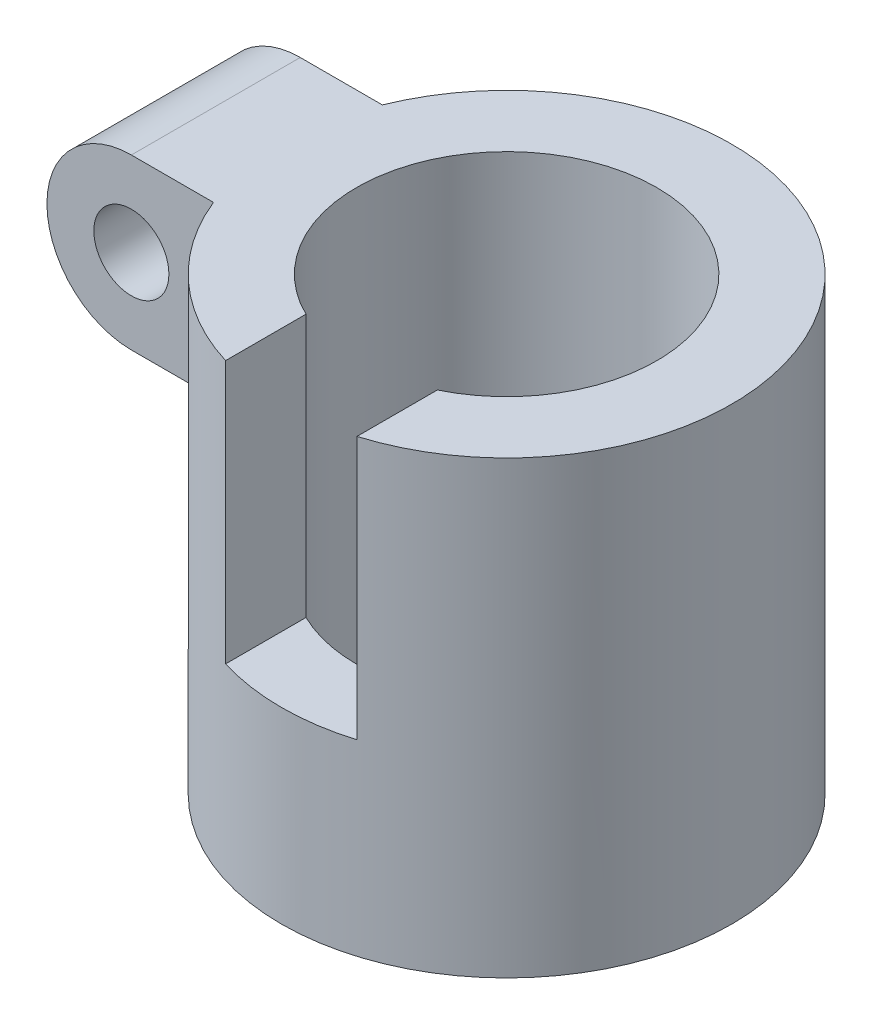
ISO-10303-21;
HEADER;
FILE_DESCRIPTION(('STEP AP214'),'2;1');
FILE_NAME('part.step','',(''),(''),'','','');
FILE_SCHEMA(('AUTOMOTIVE_DESIGN { 1 0 10303 214 1 1 1 1 }'));
ENDSEC;
DATA;
#1=APPLICATION_CONTEXT('core data for automotive mechanical design processes');
#2=APPLICATION_PROTOCOL_DEFINITION('international standard','automotive_design',2000,#1);
#3=PRODUCT_CONTEXT('',#1,'mechanical');
#4=PRODUCT('Part','Part','',(#3));
#5=PRODUCT_RELATED_PRODUCT_CATEGORY('part','',(#4));
#6=PRODUCT_DEFINITION_FORMATION('','',#4);
#7=PRODUCT_DEFINITION_CONTEXT('part definition',#1,'design');
#8=PRODUCT_DEFINITION('design','',#6,#7);
#9=PRODUCT_DEFINITION_SHAPE('','',#8);
#10=(LENGTH_UNIT() NAMED_UNIT(*) SI_UNIT(.MILLI.,.METRE.));
#11=(NAMED_UNIT(*) PLANE_ANGLE_UNIT() SI_UNIT($,.RADIAN.));
#12=(NAMED_UNIT(*) SI_UNIT($,.STERADIAN.) SOLID_ANGLE_UNIT());
#13=UNCERTAINTY_MEASURE_WITH_UNIT(LENGTH_MEASURE(1.E-05),#10,'distance_accuracy_value','');
#14=(GEOMETRIC_REPRESENTATION_CONTEXT(3) GLOBAL_UNCERTAINTY_ASSIGNED_CONTEXT((#13)) GLOBAL_UNIT_ASSIGNED_CONTEXT((#10,
#11,#12)) REPRESENTATION_CONTEXT('',''));
#15=CARTESIAN_POINT('',(0.,0.,0.));
#16=DIRECTION('',(0.,0.,1.));
#17=DIRECTION('',(1.,0.,0.));
#18=AXIS2_PLACEMENT_3D('',#15,#16,#17);
#19=CARTESIAN_POINT('',(-77.5,97.5,-22.5));
#20=DIRECTION('',(0.,0.,1.));
#21=DIRECTION('',(1.,0.,0.));
#22=AXIS2_PLACEMENT_3D('',#19,#20,#21);
#23=CYLINDRICAL_SURFACE('',#22,22.5);
#24=DIRECTION('',(0.,0.,-1.));
#25=VECTOR('',#24,1.);
#26=CARTESIAN_POINT('',(-77.5,120.,-22.5));
#27=LINE('',#26,#25);
#28=CARTESIAN_POINT('',(-77.5,120.,-22.5));
#29=VERTEX_POINT('',#28);
#30=CARTESIAN_POINT('',(-77.5,120.,22.5));
#31=VERTEX_POINT('',#30);
#32=EDGE_CURVE('E130',#29,#31,#27,.F.);
#33=ORIENTED_EDGE('',*,*,#32,.F.);
#34=CARTESIAN_POINT('',(-77.5,97.5,-22.5));
#35=DIRECTION('',(0.,0.,1.));
#36=DIRECTION('',(0.,-1.,0.));
#37=AXIS2_PLACEMENT_3D('',#34,#35,#36);
#38=CIRCLE('',#37,22.5);
#39=CARTESIAN_POINT('',(-77.5,75.,-22.5));
#40=VERTEX_POINT('',#39);
#41=EDGE_CURVE('E53',#40,#29,#38,.F.);
#42=ORIENTED_EDGE('',*,*,#41,.F.);
#43=DIRECTION('',(0.,0.,1.));
#44=VECTOR('',#43,1.);
#45=CARTESIAN_POINT('',(-77.5,75.,22.5));
#46=LINE('',#45,#44);
#47=CARTESIAN_POINT('',(-77.5,75.,22.5));
#48=VERTEX_POINT('',#47);
#49=EDGE_CURVE('E134',#48,#40,#46,.F.);
#50=ORIENTED_EDGE('',*,*,#49,.F.);
#51=CARTESIAN_POINT('',(-77.5,97.5,22.5));
#52=DIRECTION('',(0.,0.,-1.));
#53=DIRECTION('',(0.,1.,0.));
#54=AXIS2_PLACEMENT_3D('',#51,#52,#53);
#55=CIRCLE('',#54,22.5);
#56=EDGE_CURVE('E137',#31,#48,#55,.F.);
#57=ORIENTED_EDGE('',*,*,#56,.F.);
#58=EDGE_LOOP('',(#33,#42,#50,#57));
#59=FACE_BOUND('',#58,.T.);
#60=ADVANCED_FACE('F31',(#59),#23,.T.);
#61=CARTESIAN_POINT('',(0.,120.,0.));
#62=DIRECTION('',(0.,-1.,0.));
#63=DIRECTION('',(0.,0.,-1.));
#64=AXIS2_PLACEMENT_3D('',#61,#62,#63);
#65=CYLINDRICAL_SURFACE('',#64,60.);
#66=CARTESIAN_POINT('',(0.,0.,0.));
#67=DIRECTION('',(0.,1.,0.));
#68=DIRECTION('',(0.,0.,1.));
#69=AXIS2_PLACEMENT_3D('',#66,#67,#68);
#70=CIRCLE('',#69,60.);
#71=CARTESIAN_POINT('',(0.,0.,60.));
#72=VERTEX_POINT('',#71);
#73=EDGE_CURVE('E117',#72,#72,#70,.T.);
#74=ORIENTED_EDGE('',*,*,#73,.T.);
#75=EDGE_LOOP('',(#74));
#76=FACE_BOUND('',#75,.T.);
#77=CARTESIAN_POINT('',(0.,50.,0.));
#78=DIRECTION('',(0.,1.,0.));
#79=DIRECTION('',(0.,0.,1.));
#80=AXIS2_PLACEMENT_3D('',#77,#78,#79);
#81=CIRCLE('',#80,60.);
#82=CARTESIAN_POINT('',(-17.5,50.,57.391201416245));
#83=VERTEX_POINT('',#82);
#84=CARTESIAN_POINT('',(17.5,50.,57.391201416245));
#85=VERTEX_POINT('',#84);
#86=EDGE_CURVE('E150',#83,#85,#81,.T.);
#87=ORIENTED_EDGE('',*,*,#86,.F.);
#88=DIRECTION('',(0.,-1.,0.));
#89=VECTOR('',#88,1.);
#90=CARTESIAN_POINT('',(-17.5,120.,57.391201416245));
#91=LINE('',#90,#89);
#92=CARTESIAN_POINT('',(-17.5,120.,57.391201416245));
#93=VERTEX_POINT('',#92);
#94=EDGE_CURVE('E154',#83,#93,#91,.F.);
#95=ORIENTED_EDGE('',*,*,#94,.T.);
#96=CARTESIAN_POINT('',(0.,120.,0.));
#97=DIRECTION('',(0.,1.,0.));
#98=DIRECTION('',(0.,0.,1.));
#99=AXIS2_PLACEMENT_3D('',#96,#97,#98);
#100=CIRCLE('',#99,60.);
#101=CARTESIAN_POINT('',(-55.6214886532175,120.,22.5));
#102=VERTEX_POINT('',#101);
#103=EDGE_CURVE('E111',#102,#93,#100,.T.);
#104=ORIENTED_EDGE('',*,*,#103,.F.);
#105=DIRECTION('',(0.,-1.,0.));
#106=VECTOR('',#105,1.);
#107=CARTESIAN_POINT('',(-55.6214886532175,120.,22.5));
#108=LINE('',#107,#106);
#109=CARTESIAN_POINT('',(-55.6214886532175,75.,22.5));
#110=VERTEX_POINT('',#109);
#111=EDGE_CURVE('E165',#102,#110,#108,.T.);
#112=ORIENTED_EDGE('',*,*,#111,.T.);
#113=CARTESIAN_POINT('',(0.,75.,0.));
#114=DIRECTION('',(0.,1.,0.));
#115=DIRECTION('',(0.,0.,1.));
#116=AXIS2_PLACEMENT_3D('',#113,#114,#115);
#117=CIRCLE('',#116,60.);
#118=CARTESIAN_POINT('',(-55.6214886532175,75.,-22.5));
#119=VERTEX_POINT('',#118);
#120=EDGE_CURVE('E168',#110,#119,#117,.F.);
#121=ORIENTED_EDGE('',*,*,#120,.T.);
#122=DIRECTION('',(0.,-1.,0.));
#123=VECTOR('',#122,1.);
#124=CARTESIAN_POINT('',(-55.6214886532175,120.,-22.5));
#125=LINE('',#124,#123);
#126=CARTESIAN_POINT('',(-55.6214886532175,120.,-22.5));
#127=VERTEX_POINT('',#126);
#128=EDGE_CURVE('E124',#119,#127,#125,.F.);
#129=ORIENTED_EDGE('',*,*,#128,.T.);
#130=CARTESIAN_POINT('',(17.5,120.,57.391201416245));
#131=VERTEX_POINT('',#130);
#132=EDGE_CURVE('E121',#131,#127,#100,.T.);
#133=ORIENTED_EDGE('',*,*,#132,.F.);
#134=DIRECTION('',(0.,-1.,0.));
#135=VECTOR('',#134,1.);
#136=CARTESIAN_POINT('',(17.5,120.,57.391201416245));
#137=LINE('',#136,#135);
#138=EDGE_CURVE('E156',#131,#85,#137,.T.);
#139=ORIENTED_EDGE('',*,*,#138,.T.);
#140=EDGE_LOOP('',(#87,#95,#104,#112,#121,#129,#133,#139));
#141=FACE_BOUND('',#140,.T.);
#142=ADVANCED_FACE('F153',(#76,#141),#65,.T.);
#143=CARTESIAN_POINT('',(0.,120.,0.));
#144=DIRECTION('',(0.,1.,0.));
#145=DIRECTION('',(0.,0.,1.));
#146=AXIS2_PLACEMENT_3D('',#143,#144,#145);
#147=PLANE('',#146);
#148=DIRECTION('',(0.,0.,1.));
#149=VECTOR('',#148,1.);
#150=CARTESIAN_POINT('',(-17.5,120.,0.));
#151=LINE('',#150,#149);
#152=CARTESIAN_POINT('',(-17.5,120.,35.9687364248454));
#153=VERTEX_POINT('',#152);
#154=EDGE_CURVE('E97',#153,#93,#151,.T.);
#155=ORIENTED_EDGE('',*,*,#154,.F.);
#156=CARTESIAN_POINT('',(0.,120.,0.));
#157=DIRECTION('',(0.,1.,0.));
#158=DIRECTION('',(0.,0.,1.));
#159=AXIS2_PLACEMENT_3D('',#156,#157,#158);
#160=CIRCLE('',#159,40.);
#161=CARTESIAN_POINT('',(17.5,120.,35.9687364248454));
#162=VERTEX_POINT('',#161);
#163=EDGE_CURVE('E109',#162,#153,#160,.T.);
#164=ORIENTED_EDGE('',*,*,#163,.F.);
#165=DIRECTION('',(0.,0.,-1.));
#166=VECTOR('',#165,1.);
#167=CARTESIAN_POINT('',(17.5,120.,0.));
#168=LINE('',#167,#166);
#169=EDGE_CURVE('E112',#131,#162,#168,.T.);
#170=ORIENTED_EDGE('',*,*,#169,.F.);
#171=ORIENTED_EDGE('',*,*,#132,.T.);
#172=DIRECTION('',(-1.,0.,0.));
#173=VECTOR('',#172,1.);
#174=CARTESIAN_POINT('',(60.001,120.,-22.5));
#175=LINE('',#174,#173);
#176=EDGE_CURVE('E127',#127,#29,#175,.T.);
#177=ORIENTED_EDGE('',*,*,#176,.T.);
#178=ORIENTED_EDGE('',*,*,#32,.T.);
#179=DIRECTION('',(-1.,0.,0.));
#180=VECTOR('',#179,1.);
#181=CARTESIAN_POINT('',(60.001,120.,22.5));
#182=LINE('',#181,#180);
#183=EDGE_CURVE('E143',#102,#31,#182,.T.);
#184=ORIENTED_EDGE('',*,*,#183,.F.);
#185=ORIENTED_EDGE('',*,*,#103,.T.);
#186=EDGE_LOOP('',(#155,#164,#170,#171,#177,#178,#184,#185));
#187=FACE_BOUND('',#186,.T.);
#188=ADVANCED_FACE('F107',(#187),#147,.T.);
#189=CARTESIAN_POINT('',(0.,0.,0.));
#190=DIRECTION('',(0.,1.,0.));
#191=DIRECTION('',(0.,0.,1.));
#192=AXIS2_PLACEMENT_3D('',#189,#190,#191);
#193=PLANE('',#192);
#194=ORIENTED_EDGE('',*,*,#73,.F.);
#195=EDGE_LOOP('',(#194));
#196=FACE_BOUND('',#195,.T.);
#197=CARTESIAN_POINT('',(0.,0.,0.));
#198=DIRECTION('',(0.,1.,0.));
#199=DIRECTION('',(0.,0.,1.));
#200=AXIS2_PLACEMENT_3D('',#197,#198,#199);
#201=CIRCLE('',#200,40.);
#202=CARTESIAN_POINT('',(0.,0.,40.));
#203=VERTEX_POINT('',#202);
#204=EDGE_CURVE('E118',#203,#203,#201,.T.);
#205=ORIENTED_EDGE('',*,*,#204,.T.);
#206=EDGE_LOOP('',(#205));
#207=FACE_BOUND('',#206,.T.);
#208=ADVANCED_FACE('F198',(#196,#207),#193,.F.);
#209=CARTESIAN_POINT('',(0.,120.,0.));
#210=DIRECTION('',(0.,-1.,0.));
#211=DIRECTION('',(0.,0.,-1.));
#212=AXIS2_PLACEMENT_3D('',#209,#210,#211);
#213=CYLINDRICAL_SURFACE('',#212,40.);
#214=DIRECTION('',(0.,-1.,0.));
#215=VECTOR('',#214,1.);
#216=CARTESIAN_POINT('',(-17.5,120.,35.9687364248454));
#217=LINE('',#216,#215);
#218=CARTESIAN_POINT('',(-17.5,50.,35.9687364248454));
#219=VERTEX_POINT('',#218);
#220=EDGE_CURVE('E11',#219,#153,#217,.F.);
#221=ORIENTED_EDGE('',*,*,#220,.F.);
#222=CARTESIAN_POINT('',(0.,50.,0.));
#223=DIRECTION('',(0.,1.,0.));
#224=DIRECTION('',(0.,0.,1.));
#225=AXIS2_PLACEMENT_3D('',#222,#223,#224);
#226=CIRCLE('',#225,40.);
#227=CARTESIAN_POINT('',(17.5,50.,35.9687364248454));
#228=VERTEX_POINT('',#227);
#229=EDGE_CURVE('E139',#219,#228,#226,.T.);
#230=ORIENTED_EDGE('',*,*,#229,.T.);
#231=DIRECTION('',(0.,-1.,0.));
#232=VECTOR('',#231,1.);
#233=CARTESIAN_POINT('',(17.5,120.,35.9687364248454));
#234=LINE('',#233,#232);
#235=EDGE_CURVE('E38',#162,#228,#234,.T.);
#236=ORIENTED_EDGE('',*,*,#235,.F.);
#237=ORIENTED_EDGE('',*,*,#163,.T.);
#238=EDGE_LOOP('',(#221,#230,#236,#237));
#239=FACE_BOUND('',#238,.T.);
#240=ORIENTED_EDGE('',*,*,#204,.F.);
#241=EDGE_LOOP('',(#240));
#242=FACE_BOUND('',#241,.T.);
#243=ADVANCED_FACE('F115',(#239,#242),#213,.F.);
#244=CARTESIAN_POINT('',(60.001,120.,22.5));
#245=DIRECTION('',(0.,0.,-1.));
#246=DIRECTION('',(0.,1.,0.));
#247=AXIS2_PLACEMENT_3D('',#244,#245,#246);
#248=PLANE('',#247);
#249=CARTESIAN_POINT('',(-77.5,97.5,22.5));
#250=DIRECTION('',(0.,0.,1.));
#251=DIRECTION('',(1.,0.,0.));
#252=AXIS2_PLACEMENT_3D('',#249,#250,#251);
#253=CIRCLE('',#252,9.99999999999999);
#254=CARTESIAN_POINT('',(-67.5,97.5,22.5));
#255=VERTEX_POINT('',#254);
#256=EDGE_CURVE('E144',#255,#255,#253,.T.);
#257=ORIENTED_EDGE('',*,*,#256,.F.);
#258=EDGE_LOOP('',(#257));
#259=FACE_BOUND('',#258,.T.);
#260=ORIENTED_EDGE('',*,*,#183,.T.);
#261=ORIENTED_EDGE('',*,*,#56,.T.);
#262=DIRECTION('',(-1.,0.,0.));
#263=VECTOR('',#262,1.);
#264=CARTESIAN_POINT('',(60.001,75.,22.5));
#265=LINE('',#264,#263);
#266=EDGE_CURVE('E171',#110,#48,#265,.T.);
#267=ORIENTED_EDGE('',*,*,#266,.F.);
#268=ORIENTED_EDGE('',*,*,#111,.F.);
#269=EDGE_LOOP('',(#260,#261,#267,#268));
#270=FACE_BOUND('',#269,.T.);
#271=ADVANCED_FACE('F189',(#259,#270),#248,.F.);
#272=CARTESIAN_POINT('',(60.001,75.,22.5));
#273=DIRECTION('',(0.,1.,0.));
#274=DIRECTION('',(0.,0.,1.));
#275=AXIS2_PLACEMENT_3D('',#272,#273,#274);
#276=PLANE('',#275);
#277=ORIENTED_EDGE('',*,*,#266,.T.);
#278=ORIENTED_EDGE('',*,*,#49,.T.);
#279=DIRECTION('',(-1.,0.,0.));
#280=VECTOR('',#279,1.);
#281=CARTESIAN_POINT('',(60.001,75.,-22.5));
#282=LINE('',#281,#280);
#283=EDGE_CURVE('E176',#119,#40,#282,.T.);
#284=ORIENTED_EDGE('',*,*,#283,.F.);
#285=ORIENTED_EDGE('',*,*,#120,.F.);
#286=EDGE_LOOP('',(#277,#278,#284,#285));
#287=FACE_BOUND('',#286,.T.);
#288=ADVANCED_FACE('F187',(#287),#276,.F.);
#289=CARTESIAN_POINT('',(60.001,120.,-22.5));
#290=DIRECTION('',(0.,0.,1.));
#291=DIRECTION('',(0.,-1.,0.));
#292=AXIS2_PLACEMENT_3D('',#289,#290,#291);
#293=PLANE('',#292);
#294=CARTESIAN_POINT('',(-77.5,97.5,-22.5));
#295=DIRECTION('',(0.,0.,1.));
#296=DIRECTION('',(0.,-1.,0.));
#297=AXIS2_PLACEMENT_3D('',#294,#295,#296);
#298=CIRCLE('',#297,9.99999999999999);
#299=CARTESIAN_POINT('',(-77.5,87.5,-22.5));
#300=VERTEX_POINT('',#299);
#301=EDGE_CURVE('E140',#300,#300,#298,.T.);
#302=ORIENTED_EDGE('',*,*,#301,.T.);
#303=EDGE_LOOP('',(#302));
#304=FACE_BOUND('',#303,.T.);
#305=ORIENTED_EDGE('',*,*,#283,.T.);
#306=ORIENTED_EDGE('',*,*,#41,.T.);
#307=ORIENTED_EDGE('',*,*,#176,.F.);
#308=ORIENTED_EDGE('',*,*,#128,.F.);
#309=EDGE_LOOP('',(#305,#306,#307,#308));
#310=FACE_BOUND('',#309,.T.);
#311=ADVANCED_FACE('F183',(#304,#310),#293,.F.);
#312=CARTESIAN_POINT('',(-77.5,97.5,-60.));
#313=DIRECTION('',(0.,0.,1.));
#314=DIRECTION('',(1.,0.,0.));
#315=AXIS2_PLACEMENT_3D('',#312,#313,#314);
#316=CYLINDRICAL_SURFACE('',#315,9.99999999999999);
#317=ORIENTED_EDGE('',*,*,#256,.T.);
#318=EDGE_LOOP('',(#317));
#319=FACE_BOUND('',#318,.T.);
#320=ORIENTED_EDGE('',*,*,#301,.F.);
#321=EDGE_LOOP('',(#320));
#322=FACE_BOUND('',#321,.T.);
#323=ADVANCED_FACE('F213',(#319,#322),#316,.F.);
#324=CARTESIAN_POINT('',(-17.5,50.,0.));
#325=DIRECTION('',(-1.,0.,0.));
#326=DIRECTION('',(0.,0.,1.));
#327=AXIS2_PLACEMENT_3D('',#324,#325,#326);
#328=PLANE('',#327);
#329=DIRECTION('',(0.,0.,1.));
#330=VECTOR('',#329,1.);
#331=CARTESIAN_POINT('',(-17.5,50.,0.));
#332=LINE('',#331,#330);
#333=EDGE_CURVE('E100',#219,#83,#332,.T.);
#334=ORIENTED_EDGE('',*,*,#333,.F.);
#335=ORIENTED_EDGE('',*,*,#220,.T.);
#336=ORIENTED_EDGE('',*,*,#154,.T.);
#337=ORIENTED_EDGE('',*,*,#94,.F.);
#338=EDGE_LOOP('',(#334,#335,#336,#337));
#339=FACE_BOUND('',#338,.T.);
#340=ADVANCED_FACE('F96',(#339),#328,.F.);
#341=CARTESIAN_POINT('',(17.5,50.,0.));
#342=DIRECTION('',(1.,0.,0.));
#343=DIRECTION('',(0.,0.,-1.));
#344=AXIS2_PLACEMENT_3D('',#341,#342,#343);
#345=PLANE('',#344);
#346=ORIENTED_EDGE('',*,*,#169,.T.);
#347=ORIENTED_EDGE('',*,*,#235,.T.);
#348=DIRECTION('',(0.,0.,-1.));
#349=VECTOR('',#348,1.);
#350=CARTESIAN_POINT('',(17.5,50.,0.));
#351=LINE('',#350,#349);
#352=EDGE_CURVE('E45',#85,#228,#351,.T.);
#353=ORIENTED_EDGE('',*,*,#352,.F.);
#354=ORIENTED_EDGE('',*,*,#138,.F.);
#355=EDGE_LOOP('',(#346,#347,#353,#354));
#356=FACE_BOUND('',#355,.T.);
#357=ADVANCED_FACE('F146',(#356),#345,.F.);
#358=CARTESIAN_POINT('',(-17.5,50.,0.));
#359=DIRECTION('',(0.,1.,0.));
#360=DIRECTION('',(0.,0.,1.));
#361=AXIS2_PLACEMENT_3D('',#358,#359,#360);
#362=PLANE('',#361);
#363=ORIENTED_EDGE('',*,*,#86,.T.);
#364=ORIENTED_EDGE('',*,*,#352,.T.);
#365=ORIENTED_EDGE('',*,*,#229,.F.);
#366=ORIENTED_EDGE('',*,*,#333,.T.);
#367=EDGE_LOOP('',(#363,#364,#365,#366));
#368=FACE_BOUND('',#367,.T.);
#369=ADVANCED_FACE('F148',(#368),#362,.T.);
#370=CLOSED_SHELL('',(#60,#142,#188,#208,#243,#271,#288,#311,#323,#340,#357,#369));
#371=MANIFOLD_SOLID_BREP('B2',#370);
#372=ADVANCED_BREP_SHAPE_REPRESENTATION('',(#18,#371),#14);
#373=SHAPE_DEFINITION_REPRESENTATION(#9,#372);
ENDSEC;
END-ISO-10303-21;
